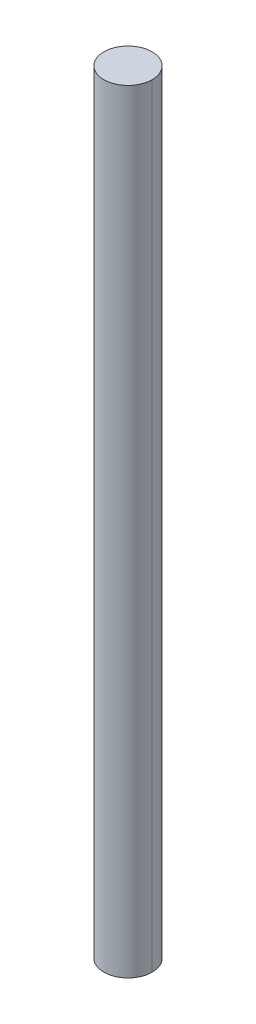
ISO-10303-21;
HEADER;
FILE_DESCRIPTION(('STEP AP214'),'2;1');
FILE_NAME('part.step','',(''),(''),'','','');
FILE_SCHEMA(('AUTOMOTIVE_DESIGN { 1 0 10303 214 1 1 1 1 }'));
ENDSEC;
DATA;
#1=APPLICATION_CONTEXT('core data for automotive mechanical design processes');
#2=APPLICATION_PROTOCOL_DEFINITION('international standard','automotive_design',2000,#1);
#3=PRODUCT_CONTEXT('',#1,'mechanical');
#4=PRODUCT('Part','Part','',(#3));
#5=PRODUCT_RELATED_PRODUCT_CATEGORY('part','',(#4));
#6=PRODUCT_DEFINITION_FORMATION('','',#4);
#7=PRODUCT_DEFINITION_CONTEXT('part definition',#1,'design');
#8=PRODUCT_DEFINITION('design','',#6,#7);
#9=PRODUCT_DEFINITION_SHAPE('','',#8);
#10=(LENGTH_UNIT() NAMED_UNIT(*) SI_UNIT(.MILLI.,.METRE.));
#11=(NAMED_UNIT(*) PLANE_ANGLE_UNIT() SI_UNIT($,.RADIAN.));
#12=(NAMED_UNIT(*) SI_UNIT($,.STERADIAN.) SOLID_ANGLE_UNIT());
#13=UNCERTAINTY_MEASURE_WITH_UNIT(LENGTH_MEASURE(1.E-05),#10,'distance_accuracy_value','');
#14=(GEOMETRIC_REPRESENTATION_CONTEXT(3) GLOBAL_UNCERTAINTY_ASSIGNED_CONTEXT((#13)) GLOBAL_UNIT_ASSIGNED_CONTEXT((#10,
#11,#12)) REPRESENTATION_CONTEXT('',''));
#15=CARTESIAN_POINT('',(0.,0.,0.));
#16=DIRECTION('',(0.,0.,1.));
#17=DIRECTION('',(1.,0.,0.));
#18=AXIS2_PLACEMENT_3D('',#15,#16,#17);
#19=CARTESIAN_POINT('',(0.,0.,0.));
#20=DIRECTION('',(0.,1.,0.));
#21=DIRECTION('',(1.,0.,0.));
#22=AXIS2_PLACEMENT_3D('',#19,#20,#21);
#23=CYLINDRICAL_SURFACE('',#22,3.175);
#24=CARTESIAN_POINT('',(-3.175,101.6,0.));
#25=CARTESIAN_POINT('',(-3.17500187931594,101.6,-0.0593727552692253));
#26=CARTESIAN_POINT('',(-3.17333465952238,101.6,-0.1187453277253));
#27=CARTESIAN_POINT('',(-3.16667552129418,101.6,-0.237303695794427));
#28=CARTESIAN_POINT('',(-3.16168360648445,101.6,-0.296489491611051));
#29=CARTESIAN_POINT('',(-3.14838858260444,101.6,-0.414487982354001));
#30=CARTESIAN_POINT('',(-3.14008547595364,101.6,-0.47330067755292));
#31=CARTESIAN_POINT('',(-3.1201947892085,101.6,-0.590367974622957));
#32=CARTESIAN_POINT('',(-3.10860721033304,101.6,-0.648622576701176));
#33=CARTESIAN_POINT('',(-3.08218387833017,101.6,-0.764390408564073));
#34=CARTESIAN_POINT('',(-3.06734812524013,101.6,-0.821903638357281));
#35=CARTESIAN_POINT('',(-3.03447516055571,101.6,-0.936007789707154));
#36=CARTESIAN_POINT('',(-3.01643794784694,101.6,-0.992598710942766));
#37=CARTESIAN_POINT('',(-2.97721879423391,101.6,-1.10468020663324));
#38=CARTESIAN_POINT('',(-2.9560368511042,101.6,-1.16017078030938));
#39=CARTESIAN_POINT('',(-2.91059487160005,101.6,-1.26987700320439));
#40=CARTESIAN_POINT('',(-2.88633483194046,101.6,-1.32409265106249));
#41=CARTESIAN_POINT('',(-2.83481303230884,101.6,-1.43107832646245));
#42=CARTESIAN_POINT('',(-2.80755127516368,101.6,-1.48384835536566));
#43=CARTESIAN_POINT('',(-2.75011188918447,101.6,-1.58777664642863));
#44=CARTESIAN_POINT('',(-2.71993426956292,101.6,-1.63893491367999));
#45=CARTESIAN_POINT('',(-2.65675810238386,101.6,-1.73947878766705));
#46=CARTESIAN_POINT('',(-2.62375956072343,101.6,-1.78886439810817));
#47=CARTESIAN_POINT('',(-2.55504535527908,101.6,-1.88570763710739));
#48=CARTESIAN_POINT('',(-2.51932969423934,101.6,-1.93316526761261));
#49=CARTESIAN_POINT('',(-2.44529359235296,101.6,-2.02600328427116));
#50=CARTESIAN_POINT('',(-2.40697315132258,101.6,-2.07138367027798));
#51=CARTESIAN_POINT('',(-2.32784801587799,101.6,-2.15992446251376));
#52=CARTESIAN_POINT('',(-2.2870433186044,101.6,-2.20308486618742));
#53=CARTESIAN_POINT('',(-2.20307800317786,101.6,-2.28704993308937));
#54=CARTESIAN_POINT('',(-2.15991737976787,101.6,-2.32785459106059));
#55=CARTESIAN_POINT('',(-2.0713759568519,101.6,-2.40697979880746));
#56=CARTESIAN_POINT('',(-2.02599515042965,101.6,-2.44530034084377));
#57=CARTESIAN_POINT('',(-1.93315638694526,101.6,-2.51933651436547));
#58=CARTESIAN_POINT('',(-1.88569843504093,101.6,-2.55505215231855));
#59=CARTESIAN_POINT('',(-1.78885480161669,101.6,-2.62376610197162));
#60=CARTESIAN_POINT('',(-1.73946912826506,101.6,-2.65676442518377));
#61=CARTESIAN_POINT('',(-1.63892537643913,101.6,-2.71994000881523));
#62=CARTESIAN_POINT('',(-1.5877673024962,101.6,-2.7501172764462));
#63=CARTESIAN_POINT('',(-1.483839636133,101.6,-2.80755587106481));
#64=CARTESIAN_POINT('',(-1.43107004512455,101.6,-2.83481720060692));
#65=CARTESIAN_POINT('',(-1.32408528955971,101.6,-2.88633819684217));
#66=CARTESIAN_POINT('',(-1.26987012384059,101.6,-2.91059786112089));
#67=CARTESIAN_POINT('',(-1.16016470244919,101.6,-2.95603922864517));
#68=CARTESIAN_POINT('',(-1.10467444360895,101.6,-2.9772209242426));
#69=CARTESIAN_POINT('',(-0.992593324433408,101.6,-3.01643971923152));
#70=CARTESIAN_POINT('',(-0.936002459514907,101.6,-3.03447680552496));
#71=CARTESIAN_POINT('',(-0.821898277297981,101.6,-3.06734956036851));
#72=CARTESIAN_POINT('',(-0.764384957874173,101.6,-3.08218522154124));
#73=CARTESIAN_POINT('',(-0.648617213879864,101.6,-3.1086083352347));
#74=CARTESIAN_POINT('',(-0.590362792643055,101.6,-3.12019580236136));
#75=CARTESIAN_POINT('',(-0.47329608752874,101.6,-3.14008612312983));
#76=CARTESIAN_POINT('',(-0.4144838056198,101.6,-3.14838898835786));
#77=CARTESIAN_POINT('',(-0.296486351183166,101.6,-3.16168402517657));
#78=CARTESIAN_POINT('',(-0.237301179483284,101.6,-3.16667620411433));
#79=CARTESIAN_POINT('',(-0.118744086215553,101.6,-3.17333418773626));
#80=CARTESIAN_POINT('',(-0.0593721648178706,101.6,-3.17499999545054));
#81=CARTESIAN_POINT('',(0.059371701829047,101.6,-3.17500000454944));
#82=CARTESIAN_POINT('',(0.118743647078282,101.6,-3.17333420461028));
#83=CARTESIAN_POINT('',(0.237300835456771,101.6,-3.16667623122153));
#84=CARTESIAN_POINT('',(0.296486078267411,101.6,-3.16168405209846));
#85=CARTESIAN_POINT('',(0.41448372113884,101.6,-3.14838900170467));
#86=CARTESIAN_POINT('',(0.47329612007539,101.6,-3.14008612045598));
#87=CARTESIAN_POINT('',(0.590363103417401,101.6,-3.12019574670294));
#88=CARTESIAN_POINT('',(0.648617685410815,101.6,-3.1086082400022));
#89=CARTESIAN_POINT('',(0.764385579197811,101.6,-3.08218506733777));
#90=CARTESIAN_POINT('',(0.821898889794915,101.6,-3.06734939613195));
#91=CARTESIAN_POINT('',(0.936002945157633,101.6,-3.03447665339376));
#92=CARTESIAN_POINT('',(0.992593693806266,101.6,-3.01643959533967));
#93=CARTESIAN_POINT('',(1.10467464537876,101.6,-2.97722084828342));
#94=CARTESIAN_POINT('',(1.16016485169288,101.6,-2.95603916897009));
#95=CARTESIAN_POINT('',(1.26987020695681,101.6,-2.91059782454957));
#96=CARTESIAN_POINT('',(1.32408535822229,101.6,-2.88633816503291));
#97=CARTESIAN_POINT('',(1.43107009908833,101.6,-2.8348171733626));
#98=CARTESIAN_POINT('',(1.48383968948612,101.6,-2.80755584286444));
#99=CARTESIAN_POINT('',(1.58776734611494,101.6,-2.7501172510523));
#100=CARTESIAN_POINT('',(1.63892541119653,101.6,-2.71993998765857));
#101=CARTESIAN_POINT('',(1.73946911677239,101.6,-2.65676443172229));
#102=CARTESIAN_POINT('',(1.78885475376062,101.6,-2.62376613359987));
#103=CARTESIAN_POINT('',(1.88569826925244,101.6,-2.5550522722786));
#104=CARTESIAN_POINT('',(1.93315614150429,101.6,-2.51933670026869));
#105=CARTESIAN_POINT('',(2.02599483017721,101.6,-2.44530060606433));
#106=CARTESIAN_POINT('',(2.07137563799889,101.6,-2.40698007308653));
#107=CARTESIAN_POINT('',(2.15991715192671,101.6,-2.3278548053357));
#108=CARTESIAN_POINT('',(2.20307786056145,101.6,-2.28705007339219));
#109=CARTESIAN_POINT('',(2.28704332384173,101.6,-2.20308486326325));
#110=CARTESIAN_POINT('',(2.32784808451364,101.6,-2.15992439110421));
#111=CARTESIAN_POINT('',(2.40697331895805,101.6,-2.07138347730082));
#112=CARTESIAN_POINT('',(2.44529379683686,101.6,-2.0260030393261));
#113=CARTESIAN_POINT('',(2.51932994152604,101.6,-1.93316494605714));
#114=CARTESIAN_POINT('',(2.55504561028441,101.6,-1.88570729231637));
#115=CARTESIAN_POINT('',(2.62375979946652,101.6,-1.78886404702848));
#116=CARTESIAN_POINT('',(2.65675831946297,101.6,-1.73947845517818));
#117=CARTESIAN_POINT('',(2.71993441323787,101.6,-1.63893467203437));
#118=CARTESIAN_POINT('',(2.7501119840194,101.6,-1.58777647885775));
#119=CARTESIAN_POINT('',(2.80755124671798,101.6,-1.48384840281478));
#120=CARTESIAN_POINT('',(2.83481293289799,101.6,-1.43107851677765));
#121=CARTESIAN_POINT('',(2.88633465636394,101.6,-1.32409303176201));
#122=CARTESIAN_POINT('',(2.91059468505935,101.6,-1.26987742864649));
#123=CARTESIAN_POINT('',(2.95603668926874,101.6,-1.16017119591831));
#124=CARTESIAN_POINT('',(2.97721866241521,101.6,-1.10468056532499));
#125=CARTESIAN_POINT('',(3.01643786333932,101.6,-0.992598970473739));
#126=CARTESIAN_POINT('',(3.03447509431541,101.6,-0.936008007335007));
#127=CARTESIAN_POINT('',(3.06734808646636,101.6,-0.821903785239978));
#128=CARTESIAN_POINT('',(3.08218384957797,101.6,-0.764390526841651));
#129=CARTESIAN_POINT('',(3.1086071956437,101.6,-0.648622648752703));
#130=CARTESIAN_POINT('',(3.12019477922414,101.6,-0.590368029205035));
#131=CARTESIAN_POINT('',(3.14008547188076,101.6,-0.473300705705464));
#132=CARTESIAN_POINT('',(3.1483885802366,101.6,-0.414488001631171));
#133=CARTESIAN_POINT('',(3.16168360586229,101.6,-0.296489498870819));
#134=CARTESIAN_POINT('',(3.16667552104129,101.6,-0.237303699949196));
#135=CARTESIAN_POINT('',(3.17333465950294,101.6,-0.118745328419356));
#136=CARTESIAN_POINT('',(3.17500187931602,101.6,-0.0593727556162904));
#137=CARTESIAN_POINT('',(3.175,101.6,0.));
#138=B_SPLINE_CURVE_WITH_KNOTS('',3,(#24,#25,#26,#27,#28,#29,#30,#31,#32,#33,#34,#35,#36,#37,
#38,#39,#40,#41,#42,#43,#44,#45,#46,#47,#48,#49,#50,#51,#52,#53,#54,#55,#56,#57,#58,#59,#60,#61,
#62,#63,#64,#65,#66,#67,#68,#69,#70,#71,#72,#73,#74,#75,#76,#77,#78,#79,#80,#81,#82,#83,#84,#85,
#86,#87,#88,#89,#90,#91,#92,#93,#94,#95,#96,#97,#98,#99,#100,#101,#102,#103,#104,#105,#106,#107,
#108,#109,#110,#111,#112,#113,#114,#115,#116,#117,#118,#119,#120,#121,#122,#123,#124,#125,#126,
#127,#128,#129,#130,#131,#132,#133,#134,#135,#136,#137),.UNSPECIFIED.,.F.,.F.,(4,2,2,2,2,2,2,2,
2,2,2,2,2,2,2,2,2,2,2,2,2,2,2,2,2,2,2,2,2,2,2,2,2,2,2,2,2,2,2,2,2,2,2,2,2,2,2,2,2,2,2,2,2,2,2,2,
4),(0.,0.178094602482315,0.356189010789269,0.534283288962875,0.712377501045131,
0.890471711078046,1.06856598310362,1.24666038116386,1.42475496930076,1.60284938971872,
1.78094324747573,1.95903673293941,2.13713003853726,2.31522335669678,2.49331687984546,
2.6714108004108,2.84950527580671,3.02759930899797,3.20569258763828,3.38378541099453,
3.56187807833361,3.73997088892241,3.91806414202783,4.09615813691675,4.27425254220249,
4.45234614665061,4.63043912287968,4.80853170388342,4.98662412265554,5.16471661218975,
5.34280940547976,5.52090273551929,5.69899683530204,5.87709122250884,6.05518485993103,
6.23327794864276,6.41137071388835,6.58946338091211,6.76755617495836,6.94564932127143,
7.12374304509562,7.30183750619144,7.4799317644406,7.65802556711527,7.83611907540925,
8.01421245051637,8.19230585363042,8.37039944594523,8.5484933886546,8.72658784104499,
8.9046824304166,9.08277683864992,9.26087113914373,9.43896540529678,9.61705971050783,
9.79515412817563,9.97324873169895),.UNSPECIFIED.);
#139=CARTESIAN_POINT('',(-3.175,101.6,0.));
#140=VERTEX_POINT('',#139);
#141=CARTESIAN_POINT('',(3.175,101.6,0.));
#142=VERTEX_POINT('',#141);
#143=EDGE_CURVE('E10',#140,#142,#138,.T.);
#144=ORIENTED_EDGE('',*,*,#143,.T.);
#145=CARTESIAN_POINT('',(3.175,0.,0.));
#146=CARTESIAN_POINT('',(3.175,0.846666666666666,0.));
#147=CARTESIAN_POINT('',(3.175,1.69333333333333,0.));
#148=CARTESIAN_POINT('',(3.175,3.38666666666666,0.));
#149=CARTESIAN_POINT('',(3.175,4.23333333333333,0.));
#150=CARTESIAN_POINT('',(3.175,5.92666666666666,0.));
#151=CARTESIAN_POINT('',(3.175,6.77333333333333,0.));
#152=CARTESIAN_POINT('',(3.175,8.46666666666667,0.));
#153=CARTESIAN_POINT('',(3.175,9.31333333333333,0.));
#154=CARTESIAN_POINT('',(3.175,11.0066666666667,0.));
#155=CARTESIAN_POINT('',(3.175,11.8533333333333,0.));
#156=CARTESIAN_POINT('',(3.175,13.5466666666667,0.));
#157=CARTESIAN_POINT('',(3.175,14.3933333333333,0.));
#158=CARTESIAN_POINT('',(3.175,16.0866666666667,0.));
#159=CARTESIAN_POINT('',(3.175,16.9333333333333,0.));
#160=CARTESIAN_POINT('',(3.175,18.6266666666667,0.));
#161=CARTESIAN_POINT('',(3.175,19.4733333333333,0.));
#162=CARTESIAN_POINT('',(3.175,21.1666666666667,0.));
#163=CARTESIAN_POINT('',(3.175,22.0133333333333,0.));
#164=CARTESIAN_POINT('',(3.175,23.7066666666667,0.));
#165=CARTESIAN_POINT('',(3.175,24.5533333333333,0.));
#166=CARTESIAN_POINT('',(3.175,26.2466666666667,0.));
#167=CARTESIAN_POINT('',(3.175,27.0933333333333,0.));
#168=CARTESIAN_POINT('',(3.175,28.7866666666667,0.));
#169=CARTESIAN_POINT('',(3.175,29.6333333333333,0.));
#170=CARTESIAN_POINT('',(3.175,31.3266666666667,0.));
#171=CARTESIAN_POINT('',(3.175,32.1733333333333,0.));
#172=CARTESIAN_POINT('',(3.175,33.8666666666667,0.));
#173=CARTESIAN_POINT('',(3.175,34.7133333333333,0.));
#174=CARTESIAN_POINT('',(3.175,36.4066666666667,0.));
#175=CARTESIAN_POINT('',(3.175,37.2533333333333,0.));
#176=CARTESIAN_POINT('',(3.175,38.9466666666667,0.));
#177=CARTESIAN_POINT('',(3.175,39.7933333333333,0.));
#178=CARTESIAN_POINT('',(3.175,41.4866666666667,0.));
#179=CARTESIAN_POINT('',(3.175,42.3333333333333,0.));
#180=CARTESIAN_POINT('',(3.175,44.0266666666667,0.));
#181=CARTESIAN_POINT('',(3.175,44.8733333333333,0.));
#182=CARTESIAN_POINT('',(3.175,46.5666666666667,0.));
#183=CARTESIAN_POINT('',(3.175,47.4133333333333,0.));
#184=CARTESIAN_POINT('',(3.175,49.1066666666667,0.));
#185=CARTESIAN_POINT('',(3.175,49.9533333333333,0.));
#186=CARTESIAN_POINT('',(3.175,51.6466666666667,0.));
#187=CARTESIAN_POINT('',(3.175,52.4933333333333,0.));
#188=CARTESIAN_POINT('',(3.175,54.1866666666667,0.));
#189=CARTESIAN_POINT('',(3.175,55.0333333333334,0.));
#190=CARTESIAN_POINT('',(3.175,56.7266666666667,0.));
#191=CARTESIAN_POINT('',(3.175,57.5733333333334,0.));
#192=CARTESIAN_POINT('',(3.175,59.2666666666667,0.));
#193=CARTESIAN_POINT('',(3.175,60.1133333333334,0.));
#194=CARTESIAN_POINT('',(3.175,61.8066666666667,0.));
#195=CARTESIAN_POINT('',(3.175,62.6533333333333,0.));
#196=CARTESIAN_POINT('',(3.175,64.3466666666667,0.));
#197=CARTESIAN_POINT('',(3.175,65.1933333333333,0.));
#198=CARTESIAN_POINT('',(3.175,66.8866666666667,0.));
#199=CARTESIAN_POINT('',(3.175,67.7333333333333,0.));
#200=CARTESIAN_POINT('',(3.175,69.4266666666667,0.));
#201=CARTESIAN_POINT('',(3.175,70.2733333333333,0.));
#202=CARTESIAN_POINT('',(3.175,71.9666666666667,0.));
#203=CARTESIAN_POINT('',(3.175,72.8133333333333,0.));
#204=CARTESIAN_POINT('',(3.175,74.5066666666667,0.));
#205=CARTESIAN_POINT('',(3.175,75.3533333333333,0.));
#206=CARTESIAN_POINT('',(3.175,77.0466666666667,0.));
#207=CARTESIAN_POINT('',(3.175,77.8933333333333,0.));
#208=CARTESIAN_POINT('',(3.175,79.5866666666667,0.));
#209=CARTESIAN_POINT('',(3.175,80.4333333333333,0.));
#210=CARTESIAN_POINT('',(3.175,82.1266666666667,0.));
#211=CARTESIAN_POINT('',(3.175,82.9733333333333,0.));
#212=CARTESIAN_POINT('',(3.175,84.6666666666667,0.));
#213=CARTESIAN_POINT('',(3.175,85.5133333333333,0.));
#214=CARTESIAN_POINT('',(3.175,87.2066666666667,0.));
#215=CARTESIAN_POINT('',(3.175,88.0533333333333,0.));
#216=CARTESIAN_POINT('',(3.175,89.7466666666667,0.));
#217=CARTESIAN_POINT('',(3.175,90.5933333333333,0.));
#218=CARTESIAN_POINT('',(3.175,92.2866666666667,0.));
#219=CARTESIAN_POINT('',(3.175,93.1333333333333,0.));
#220=CARTESIAN_POINT('',(3.175,94.8266666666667,0.));
#221=CARTESIAN_POINT('',(3.175,95.6733333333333,0.));
#222=CARTESIAN_POINT('',(3.175,97.3666666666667,0.));
#223=CARTESIAN_POINT('',(3.175,98.2133333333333,0.));
#224=CARTESIAN_POINT('',(3.175,99.9066666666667,0.));
#225=CARTESIAN_POINT('',(3.175,100.753333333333,0.));
#226=CARTESIAN_POINT('',(3.175,101.6,0.));
#227=B_SPLINE_CURVE_WITH_KNOTS('',3,(#145,#146,#147,#148,#149,#150,#151,#152,#153,#154,#155,
#156,#157,#158,#159,#160,#161,#162,#163,#164,#165,#166,#167,#168,#169,#170,#171,#172,#173,#174,
#175,#176,#177,#178,#179,#180,#181,#182,#183,#184,#185,#186,#187,#188,#189,#190,#191,#192,#193,
#194,#195,#196,#197,#198,#199,#200,#201,#202,#203,#204,#205,#206,#207,#208,#209,#210,#211,#212,
#213,#214,#215,#216,#217,#218,#219,#220,#221,#222,#223,#224,#225,#226),.UNSPECIFIED.,.F.,.F.,(4,
2,2,2,2,2,2,2,2,2,2,2,2,2,2,2,2,2,2,2,2,2,2,2,2,2,2,2,2,2,2,2,2,2,2,2,2,2,2,2,4),(0.,2.54,5.08,
7.62,10.16,12.7,15.24,17.78,20.32,22.86,25.4,27.94,30.48,33.02,35.56,38.1,40.64,43.18,45.72,
48.26,50.8,53.34,55.88,58.42,60.96,63.5,66.04,68.58,71.12,73.66,76.2,78.74,81.28,83.82,86.36,
88.9,91.44,93.98,96.52,99.06,101.6),.UNSPECIFIED.);
#228=CARTESIAN_POINT('',(3.175,0.,0.));
#229=VERTEX_POINT('',#228);
#230=EDGE_CURVE('E33',#229,#142,#227,.T.);
#231=ORIENTED_EDGE('',*,*,#230,.F.);
#232=CARTESIAN_POINT('',(3.175,0.,0.));
#233=CARTESIAN_POINT('',(3.17500187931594,0.,-0.0593727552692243));
#234=CARTESIAN_POINT('',(3.17333465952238,0.,-0.118745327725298));
#235=CARTESIAN_POINT('',(3.16667552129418,0.,-0.237303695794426));
#236=CARTESIAN_POINT('',(3.16168360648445,0.,-0.296489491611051));
#237=CARTESIAN_POINT('',(3.14838858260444,0.,-0.414487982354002));
#238=CARTESIAN_POINT('',(3.14008547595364,0.,-0.47330067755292));
#239=CARTESIAN_POINT('',(3.1201947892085,0.,-0.590367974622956));
#240=CARTESIAN_POINT('',(3.10860721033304,0.,-0.648622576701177));
#241=CARTESIAN_POINT('',(3.08218387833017,0.,-0.764390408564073));
#242=CARTESIAN_POINT('',(3.06734812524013,0.,-0.82190363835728));
#243=CARTESIAN_POINT('',(3.03447516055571,0.,-0.936007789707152));
#244=CARTESIAN_POINT('',(3.01643794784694,0.,-0.992598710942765));
#245=CARTESIAN_POINT('',(2.97721879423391,0.,-1.10468020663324));
#246=CARTESIAN_POINT('',(2.9560368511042,0.,-1.16017078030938));
#247=CARTESIAN_POINT('',(2.91059487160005,0.,-1.26987700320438));
#248=CARTESIAN_POINT('',(2.88633483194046,0.,-1.32409265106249));
#249=CARTESIAN_POINT('',(2.83481303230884,0.,-1.43107832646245));
#250=CARTESIAN_POINT('',(2.80755127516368,0.,-1.48384835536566));
#251=CARTESIAN_POINT('',(2.75011188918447,0.,-1.58777664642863));
#252=CARTESIAN_POINT('',(2.71993426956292,0.,-1.63893491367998));
#253=CARTESIAN_POINT('',(2.65675810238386,0.,-1.73947878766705));
#254=CARTESIAN_POINT('',(2.62375956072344,0.,-1.78886439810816));
#255=CARTESIAN_POINT('',(2.55504535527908,0.,-1.88570763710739));
#256=CARTESIAN_POINT('',(2.51932969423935,0.,-1.93316526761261));
#257=CARTESIAN_POINT('',(2.44529359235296,0.,-2.02600328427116));
#258=CARTESIAN_POINT('',(2.40697315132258,0.,-2.07138367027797));
#259=CARTESIAN_POINT('',(2.32784801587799,0.,-2.15992446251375));
#260=CARTESIAN_POINT('',(2.2870433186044,0.,-2.20308486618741));
#261=CARTESIAN_POINT('',(2.20307800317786,0.,-2.28704993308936));
#262=CARTESIAN_POINT('',(2.15991737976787,0.,-2.32785459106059));
#263=CARTESIAN_POINT('',(2.0713759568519,0.,-2.40697979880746));
#264=CARTESIAN_POINT('',(2.02599515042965,0.,-2.44530034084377));
#265=CARTESIAN_POINT('',(1.93315638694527,0.,-2.51933651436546));
#266=CARTESIAN_POINT('',(1.88569843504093,0.,-2.55505215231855));
#267=CARTESIAN_POINT('',(1.78885480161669,0.,-2.62376610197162));
#268=CARTESIAN_POINT('',(1.73946912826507,0.,-2.65676442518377));
#269=CARTESIAN_POINT('',(1.63892537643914,0.,-2.71994000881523));
#270=CARTESIAN_POINT('',(1.5877673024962,0.,-2.7501172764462));
#271=CARTESIAN_POINT('',(1.48383963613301,0.,-2.80755587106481));
#272=CARTESIAN_POINT('',(1.43107004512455,0.,-2.83481720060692));
#273=CARTESIAN_POINT('',(1.32408528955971,0.,-2.88633819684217));
#274=CARTESIAN_POINT('',(1.2698701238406,0.,-2.91059786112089));
#275=CARTESIAN_POINT('',(1.16016470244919,0.,-2.95603922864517));
#276=CARTESIAN_POINT('',(1.10467444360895,0.,-2.9772209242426));
#277=CARTESIAN_POINT('',(0.99259332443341,0.,-3.01643971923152));
#278=CARTESIAN_POINT('',(0.936002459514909,0.,-3.03447680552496));
#279=CARTESIAN_POINT('',(0.821898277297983,0.,-3.06734956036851));
#280=CARTESIAN_POINT('',(0.764384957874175,0.,-3.08218522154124));
#281=CARTESIAN_POINT('',(0.648617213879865,0.,-3.1086083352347));
#282=CARTESIAN_POINT('',(0.590362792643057,0.,-3.12019580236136));
#283=CARTESIAN_POINT('',(0.473296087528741,0.,-3.14008612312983));
#284=CARTESIAN_POINT('',(0.4144838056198,0.,-3.14838898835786));
#285=CARTESIAN_POINT('',(0.296486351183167,0.,-3.16168402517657));
#286=CARTESIAN_POINT('',(0.237301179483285,0.,-3.16667620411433));
#287=CARTESIAN_POINT('',(0.118744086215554,0.,-3.17333418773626));
#288=CARTESIAN_POINT('',(0.0593721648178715,0.,-3.17499999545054));
#289=CARTESIAN_POINT('',(-0.0593717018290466,0.,-3.17500000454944));
#290=CARTESIAN_POINT('',(-0.118743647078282,0.,-3.17333420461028));
#291=CARTESIAN_POINT('',(-0.23730083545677,0.,-3.16667623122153));
#292=CARTESIAN_POINT('',(-0.29648607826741,0.,-3.16168405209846));
#293=CARTESIAN_POINT('',(-0.414483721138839,0.,-3.14838900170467));
#294=CARTESIAN_POINT('',(-0.473296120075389,0.,-3.14008612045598));
#295=CARTESIAN_POINT('',(-0.5903631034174,0.,-3.12019574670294));
#296=CARTESIAN_POINT('',(-0.648617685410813,0.,-3.1086082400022));
#297=CARTESIAN_POINT('',(-0.764385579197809,0.,-3.08218506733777));
#298=CARTESIAN_POINT('',(-0.821898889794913,0.,-3.06734939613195));
#299=CARTESIAN_POINT('',(-0.936002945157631,0.,-3.03447665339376));
#300=CARTESIAN_POINT('',(-0.992593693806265,0.,-3.01643959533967));
#301=CARTESIAN_POINT('',(-1.10467464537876,0.,-2.97722084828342));
#302=CARTESIAN_POINT('',(-1.16016485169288,0.,-2.95603916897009));
#303=CARTESIAN_POINT('',(-1.26987020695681,0.,-2.91059782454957));
#304=CARTESIAN_POINT('',(-1.32408535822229,0.,-2.88633816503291));
#305=CARTESIAN_POINT('',(-1.43107009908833,0.,-2.8348171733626));
#306=CARTESIAN_POINT('',(-1.48383968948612,0.,-2.80755584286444));
#307=CARTESIAN_POINT('',(-1.58776734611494,0.,-2.7501172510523));
#308=CARTESIAN_POINT('',(-1.63892541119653,0.,-2.71993998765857));
#309=CARTESIAN_POINT('',(-1.73946911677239,0.,-2.65676443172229));
#310=CARTESIAN_POINT('',(-1.78885475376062,0.,-2.62376613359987));
#311=CARTESIAN_POINT('',(-1.88569826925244,0.,-2.5550522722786));
#312=CARTESIAN_POINT('',(-1.93315614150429,0.,-2.51933670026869));
#313=CARTESIAN_POINT('',(-2.02599483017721,0.,-2.44530060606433));
#314=CARTESIAN_POINT('',(-2.07137563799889,0.,-2.40698007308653));
#315=CARTESIAN_POINT('',(-2.15991715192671,0.,-2.3278548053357));
#316=CARTESIAN_POINT('',(-2.20307786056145,0.,-2.28705007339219));
#317=CARTESIAN_POINT('',(-2.28704332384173,0.,-2.20308486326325));
#318=CARTESIAN_POINT('',(-2.32784808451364,0.,-2.15992439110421));
#319=CARTESIAN_POINT('',(-2.40697331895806,0.,-2.07138347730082));
#320=CARTESIAN_POINT('',(-2.44529379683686,0.,-2.0260030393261));
#321=CARTESIAN_POINT('',(-2.51932994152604,0.,-1.93316494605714));
#322=CARTESIAN_POINT('',(-2.55504561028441,0.,-1.88570729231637));
#323=CARTESIAN_POINT('',(-2.62375979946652,0.,-1.78886404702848));
#324=CARTESIAN_POINT('',(-2.65675831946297,0.,-1.73947845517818));
#325=CARTESIAN_POINT('',(-2.71993441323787,0.,-1.63893467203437));
#326=CARTESIAN_POINT('',(-2.7501119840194,0.,-1.58777647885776));
#327=CARTESIAN_POINT('',(-2.80755124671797,0.,-1.48384840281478));
#328=CARTESIAN_POINT('',(-2.83481293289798,0.,-1.43107851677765));
#329=CARTESIAN_POINT('',(-2.88633465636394,0.,-1.32409303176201));
#330=CARTESIAN_POINT('',(-2.91059468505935,0.,-1.2698774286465));
#331=CARTESIAN_POINT('',(-2.95603668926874,0.,-1.16017119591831));
#332=CARTESIAN_POINT('',(-2.97721866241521,0.,-1.10468056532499));
#333=CARTESIAN_POINT('',(-3.01643786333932,0.,-0.992598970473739));
#334=CARTESIAN_POINT('',(-3.03447509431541,0.,-0.936008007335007));
#335=CARTESIAN_POINT('',(-3.06734808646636,0.,-0.821903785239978));
#336=CARTESIAN_POINT('',(-3.08218384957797,0.,-0.764390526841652));
#337=CARTESIAN_POINT('',(-3.1086071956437,0.,-0.648622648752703));
#338=CARTESIAN_POINT('',(-3.12019477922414,0.,-0.590368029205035));
#339=CARTESIAN_POINT('',(-3.14008547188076,0.,-0.473300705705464));
#340=CARTESIAN_POINT('',(-3.1483885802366,0.,-0.414488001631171));
#341=CARTESIAN_POINT('',(-3.16168360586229,0.,-0.29648949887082));
#342=CARTESIAN_POINT('',(-3.16667552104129,0.,-0.237303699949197));
#343=CARTESIAN_POINT('',(-3.17333465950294,0.,-0.118745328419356));
#344=CARTESIAN_POINT('',(-3.17500187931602,0.,-0.0593727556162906));
#345=CARTESIAN_POINT('',(-3.175,0.,0.));
#346=B_SPLINE_CURVE_WITH_KNOTS('',3,(#232,#233,#234,#235,#236,#237,#238,#239,#240,#241,#242,
#243,#244,#245,#246,#247,#248,#249,#250,#251,#252,#253,#254,#255,#256,#257,#258,#259,#260,#261,
#262,#263,#264,#265,#266,#267,#268,#269,#270,#271,#272,#273,#274,#275,#276,#277,#278,#279,#280,
#281,#282,#283,#284,#285,#286,#287,#288,#289,#290,#291,#292,#293,#294,#295,#296,#297,#298,#299,
#300,#301,#302,#303,#304,#305,#306,#307,#308,#309,#310,#311,#312,#313,#314,#315,#316,#317,#318,
#319,#320,#321,#322,#323,#324,#325,#326,#327,#328,#329,#330,#331,#332,#333,#334,#335,#336,#337,
#338,#339,#340,#341,#342,#343,#344,#345),.UNSPECIFIED.,.F.,.F.,(4,2,2,2,2,2,2,2,2,2,2,2,2,2,2,2,
2,2,2,2,2,2,2,2,2,2,2,2,2,2,2,2,2,2,2,2,2,2,2,2,2,2,2,2,2,2,2,2,2,2,2,2,2,2,2,2,4),(0.,
0.178094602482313,0.35618901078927,0.534283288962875,0.712377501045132,0.890471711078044,
1.06856598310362,1.24666038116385,1.42475496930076,1.60284938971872,1.78094324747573,
1.95903673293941,2.13713003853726,2.31522335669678,2.49331687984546,2.6714108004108,
2.84950527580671,3.02759930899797,3.20569258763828,3.38378541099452,3.5618780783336,
3.73997088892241,3.91806414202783,4.09615813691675,4.27425254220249,4.45234614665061,
4.63043912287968,4.80853170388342,4.98662412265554,5.16471661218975,5.34280940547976,
5.52090273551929,5.69899683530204,5.87709122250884,6.05518485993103,6.23327794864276,
6.41137071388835,6.58946338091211,6.76755617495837,6.94564932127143,7.12374304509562,
7.30183750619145,7.4799317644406,7.65802556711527,7.83611907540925,8.01421245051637,
8.19230585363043,8.37039944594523,8.5484933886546,8.72658784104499,8.9046824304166,
9.08277683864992,9.26087113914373,9.43896540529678,9.61705971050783,9.79515412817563,
9.97324873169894),.UNSPECIFIED.);
#347=CARTESIAN_POINT('',(-3.175,0.,0.));
#348=VERTEX_POINT('',#347);
#349=EDGE_CURVE('E23',#229,#348,#346,.T.);
#350=ORIENTED_EDGE('',*,*,#349,.T.);
#351=CARTESIAN_POINT('',(-3.175,0.,0.));
#352=CARTESIAN_POINT('',(-3.175,0.846666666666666,0.));
#353=CARTESIAN_POINT('',(-3.175,1.69333333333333,0.));
#354=CARTESIAN_POINT('',(-3.175,3.38666666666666,0.));
#355=CARTESIAN_POINT('',(-3.175,4.23333333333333,0.));
#356=CARTESIAN_POINT('',(-3.175,5.92666666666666,0.));
#357=CARTESIAN_POINT('',(-3.175,6.77333333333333,0.));
#358=CARTESIAN_POINT('',(-3.175,8.46666666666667,0.));
#359=CARTESIAN_POINT('',(-3.175,9.31333333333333,0.));
#360=CARTESIAN_POINT('',(-3.175,11.0066666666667,0.));
#361=CARTESIAN_POINT('',(-3.175,11.8533333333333,0.));
#362=CARTESIAN_POINT('',(-3.175,13.5466666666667,0.));
#363=CARTESIAN_POINT('',(-3.175,14.3933333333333,0.));
#364=CARTESIAN_POINT('',(-3.175,16.0866666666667,0.));
#365=CARTESIAN_POINT('',(-3.175,16.9333333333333,0.));
#366=CARTESIAN_POINT('',(-3.175,18.6266666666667,0.));
#367=CARTESIAN_POINT('',(-3.175,19.4733333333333,0.));
#368=CARTESIAN_POINT('',(-3.175,21.1666666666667,0.));
#369=CARTESIAN_POINT('',(-3.175,22.0133333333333,0.));
#370=CARTESIAN_POINT('',(-3.175,23.7066666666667,0.));
#371=CARTESIAN_POINT('',(-3.175,24.5533333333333,0.));
#372=CARTESIAN_POINT('',(-3.175,26.2466666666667,0.));
#373=CARTESIAN_POINT('',(-3.175,27.0933333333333,0.));
#374=CARTESIAN_POINT('',(-3.175,28.7866666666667,0.));
#375=CARTESIAN_POINT('',(-3.175,29.6333333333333,0.));
#376=CARTESIAN_POINT('',(-3.175,31.3266666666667,0.));
#377=CARTESIAN_POINT('',(-3.175,32.1733333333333,0.));
#378=CARTESIAN_POINT('',(-3.175,33.8666666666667,0.));
#379=CARTESIAN_POINT('',(-3.175,34.7133333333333,0.));
#380=CARTESIAN_POINT('',(-3.175,36.4066666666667,0.));
#381=CARTESIAN_POINT('',(-3.175,37.2533333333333,0.));
#382=CARTESIAN_POINT('',(-3.175,38.9466666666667,0.));
#383=CARTESIAN_POINT('',(-3.175,39.7933333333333,0.));
#384=CARTESIAN_POINT('',(-3.175,41.4866666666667,0.));
#385=CARTESIAN_POINT('',(-3.175,42.3333333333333,0.));
#386=CARTESIAN_POINT('',(-3.175,44.0266666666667,0.));
#387=CARTESIAN_POINT('',(-3.175,44.8733333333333,0.));
#388=CARTESIAN_POINT('',(-3.175,46.5666666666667,0.));
#389=CARTESIAN_POINT('',(-3.175,47.4133333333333,0.));
#390=CARTESIAN_POINT('',(-3.175,49.1066666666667,0.));
#391=CARTESIAN_POINT('',(-3.175,49.9533333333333,0.));
#392=CARTESIAN_POINT('',(-3.175,51.6466666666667,0.));
#393=CARTESIAN_POINT('',(-3.175,52.4933333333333,0.));
#394=CARTESIAN_POINT('',(-3.175,54.1866666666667,0.));
#395=CARTESIAN_POINT('',(-3.175,55.0333333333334,0.));
#396=CARTESIAN_POINT('',(-3.175,56.7266666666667,0.));
#397=CARTESIAN_POINT('',(-3.175,57.5733333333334,0.));
#398=CARTESIAN_POINT('',(-3.175,59.2666666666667,0.));
#399=CARTESIAN_POINT('',(-3.175,60.1133333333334,0.));
#400=CARTESIAN_POINT('',(-3.175,61.8066666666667,0.));
#401=CARTESIAN_POINT('',(-3.175,62.6533333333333,0.));
#402=CARTESIAN_POINT('',(-3.175,64.3466666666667,0.));
#403=CARTESIAN_POINT('',(-3.175,65.1933333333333,0.));
#404=CARTESIAN_POINT('',(-3.175,66.8866666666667,0.));
#405=CARTESIAN_POINT('',(-3.175,67.7333333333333,0.));
#406=CARTESIAN_POINT('',(-3.175,69.4266666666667,0.));
#407=CARTESIAN_POINT('',(-3.175,70.2733333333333,0.));
#408=CARTESIAN_POINT('',(-3.175,71.9666666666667,0.));
#409=CARTESIAN_POINT('',(-3.175,72.8133333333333,0.));
#410=CARTESIAN_POINT('',(-3.175,74.5066666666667,0.));
#411=CARTESIAN_POINT('',(-3.175,75.3533333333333,0.));
#412=CARTESIAN_POINT('',(-3.175,77.0466666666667,0.));
#413=CARTESIAN_POINT('',(-3.175,77.8933333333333,0.));
#414=CARTESIAN_POINT('',(-3.175,79.5866666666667,0.));
#415=CARTESIAN_POINT('',(-3.175,80.4333333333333,0.));
#416=CARTESIAN_POINT('',(-3.175,82.1266666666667,0.));
#417=CARTESIAN_POINT('',(-3.175,82.9733333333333,0.));
#418=CARTESIAN_POINT('',(-3.175,84.6666666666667,0.));
#419=CARTESIAN_POINT('',(-3.175,85.5133333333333,0.));
#420=CARTESIAN_POINT('',(-3.175,87.2066666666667,0.));
#421=CARTESIAN_POINT('',(-3.175,88.0533333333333,0.));
#422=CARTESIAN_POINT('',(-3.175,89.7466666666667,0.));
#423=CARTESIAN_POINT('',(-3.175,90.5933333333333,0.));
#424=CARTESIAN_POINT('',(-3.175,92.2866666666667,0.));
#425=CARTESIAN_POINT('',(-3.175,93.1333333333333,0.));
#426=CARTESIAN_POINT('',(-3.175,94.8266666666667,0.));
#427=CARTESIAN_POINT('',(-3.175,95.6733333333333,0.));
#428=CARTESIAN_POINT('',(-3.175,97.3666666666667,0.));
#429=CARTESIAN_POINT('',(-3.175,98.2133333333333,0.));
#430=CARTESIAN_POINT('',(-3.175,99.9066666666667,0.));
#431=CARTESIAN_POINT('',(-3.175,100.753333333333,0.));
#432=CARTESIAN_POINT('',(-3.175,101.6,0.));
#433=B_SPLINE_CURVE_WITH_KNOTS('',3,(#351,#352,#353,#354,#355,#356,#357,#358,#359,#360,#361,
#362,#363,#364,#365,#366,#367,#368,#369,#370,#371,#372,#373,#374,#375,#376,#377,#378,#379,#380,
#381,#382,#383,#384,#385,#386,#387,#388,#389,#390,#391,#392,#393,#394,#395,#396,#397,#398,#399,
#400,#401,#402,#403,#404,#405,#406,#407,#408,#409,#410,#411,#412,#413,#414,#415,#416,#417,#418,
#419,#420,#421,#422,#423,#424,#425,#426,#427,#428,#429,#430,#431,#432),.UNSPECIFIED.,.F.,.F.,(4,
2,2,2,2,2,2,2,2,2,2,2,2,2,2,2,2,2,2,2,2,2,2,2,2,2,2,2,2,2,2,2,2,2,2,2,2,2,2,2,4),(0.,2.54,5.08,
7.62,10.16,12.7,15.24,17.78,20.32,22.86,25.4,27.94,30.48,33.02,35.56,38.1,40.64,43.18,45.72,
48.26,50.8,53.34,55.88,58.42,60.96,63.5,66.04,68.58,71.12,73.66,76.2,78.74,81.28,83.82,86.36,
88.9,91.44,93.98,96.52,99.06,101.6),.UNSPECIFIED.);
#434=EDGE_CURVE('E40',#348,#140,#433,.T.);
#435=ORIENTED_EDGE('',*,*,#434,.T.);
#436=EDGE_LOOP('',(#144,#231,#350,#435));
#437=FACE_BOUND('',#436,.T.);
#438=ADVANCED_FACE('F15',(#437),#23,.T.);
#439=CARTESIAN_POINT('',(-3.175,101.6,-3.26462344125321));
#440=DIRECTION('',(0.,1.,0.));
#441=DIRECTION('',(0.,0.,1.));
#442=AXIS2_PLACEMENT_3D('',#439,#440,#441);
#443=PLANE('',#442);
#444=ORIENTED_EDGE('',*,*,#143,.F.);
#445=CARTESIAN_POINT('',(3.175,101.6,0.));
#446=CARTESIAN_POINT('',(3.17500187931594,101.6,0.0593727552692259));
#447=CARTESIAN_POINT('',(3.17333465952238,101.6,0.1187453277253));
#448=CARTESIAN_POINT('',(3.16667552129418,101.6,0.237303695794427));
#449=CARTESIAN_POINT('',(3.16168360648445,101.6,0.296489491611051));
#450=CARTESIAN_POINT('',(3.14838858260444,101.6,0.414487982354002));
#451=CARTESIAN_POINT('',(3.14008547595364,101.6,0.47330067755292));
#452=CARTESIAN_POINT('',(3.1201947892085,101.6,0.590367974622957));
#453=CARTESIAN_POINT('',(3.10860721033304,101.6,0.648622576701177));
#454=CARTESIAN_POINT('',(3.08218387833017,101.6,0.764390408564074));
#455=CARTESIAN_POINT('',(3.06734812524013,101.6,0.821903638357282));
#456=CARTESIAN_POINT('',(3.03447516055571,101.6,0.936007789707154));
#457=CARTESIAN_POINT('',(3.01643794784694,101.6,0.992598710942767));
#458=CARTESIAN_POINT('',(2.97721879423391,101.6,1.10468020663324));
#459=CARTESIAN_POINT('',(2.9560368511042,101.6,1.16017078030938));
#460=CARTESIAN_POINT('',(2.91059487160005,101.6,1.26987700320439));
#461=CARTESIAN_POINT('',(2.88633483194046,101.6,1.32409265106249));
#462=CARTESIAN_POINT('',(2.83481303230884,101.6,1.43107832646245));
#463=CARTESIAN_POINT('',(2.80755127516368,101.6,1.48384835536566));
#464=CARTESIAN_POINT('',(2.75011188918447,101.6,1.58777664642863));
#465=CARTESIAN_POINT('',(2.71993426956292,101.6,1.63893491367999));
#466=CARTESIAN_POINT('',(2.65675810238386,101.6,1.73947878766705));
#467=CARTESIAN_POINT('',(2.62375956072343,101.6,1.78886439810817));
#468=CARTESIAN_POINT('',(2.55504535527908,101.6,1.88570763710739));
#469=CARTESIAN_POINT('',(2.51932969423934,101.6,1.93316526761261));
#470=CARTESIAN_POINT('',(2.44529359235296,101.6,2.02600328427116));
#471=CARTESIAN_POINT('',(2.40697315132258,101.6,2.07138367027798));
#472=CARTESIAN_POINT('',(2.32784801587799,101.6,2.15992446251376));
#473=CARTESIAN_POINT('',(2.2870433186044,101.6,2.20308486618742));
#474=CARTESIAN_POINT('',(2.20307800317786,101.6,2.28704993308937));
#475=CARTESIAN_POINT('',(2.15991737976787,101.6,2.32785459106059));
#476=CARTESIAN_POINT('',(2.0713759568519,101.6,2.40697979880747));
#477=CARTESIAN_POINT('',(2.02599515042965,101.6,2.44530034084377));
#478=CARTESIAN_POINT('',(1.93315638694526,101.6,2.51933651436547));
#479=CARTESIAN_POINT('',(1.88569843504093,101.6,2.55505215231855));
#480=CARTESIAN_POINT('',(1.78885480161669,101.6,2.62376610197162));
#481=CARTESIAN_POINT('',(1.73946912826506,101.6,2.65676442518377));
#482=CARTESIAN_POINT('',(1.63892537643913,101.6,2.71994000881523));
#483=CARTESIAN_POINT('',(1.5877673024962,101.6,2.7501172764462));
#484=CARTESIAN_POINT('',(1.483839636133,101.6,2.80755587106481));
#485=CARTESIAN_POINT('',(1.43107004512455,101.6,2.83481720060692));
#486=CARTESIAN_POINT('',(1.3240852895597,101.6,2.88633819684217));
#487=CARTESIAN_POINT('',(1.26987012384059,101.6,2.91059786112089));
#488=CARTESIAN_POINT('',(1.16016470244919,101.6,2.95603922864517));
#489=CARTESIAN_POINT('',(1.10467444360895,101.6,2.9772209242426));
#490=CARTESIAN_POINT('',(0.992593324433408,101.6,3.01643971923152));
#491=CARTESIAN_POINT('',(0.936002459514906,101.6,3.03447680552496));
#492=CARTESIAN_POINT('',(0.82189827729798,101.6,3.06734956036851));
#493=CARTESIAN_POINT('',(0.764384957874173,101.6,3.08218522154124));
#494=CARTESIAN_POINT('',(0.648617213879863,101.6,3.1086083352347));
#495=CARTESIAN_POINT('',(0.590362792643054,101.6,3.12019580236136));
#496=CARTESIAN_POINT('',(0.473296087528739,101.6,3.14008612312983));
#497=CARTESIAN_POINT('',(0.414483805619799,101.6,3.14838898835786));
#498=CARTESIAN_POINT('',(0.296486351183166,101.6,3.16168402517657));
#499=CARTESIAN_POINT('',(0.237301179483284,101.6,3.16667620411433));
#500=CARTESIAN_POINT('',(0.118744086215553,101.6,3.17333418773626));
#501=CARTESIAN_POINT('',(0.0593721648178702,101.6,3.17499999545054));
#502=CARTESIAN_POINT('',(-0.0593717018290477,101.6,3.17500000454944));
#503=CARTESIAN_POINT('',(-0.118743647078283,101.6,3.17333420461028));
#504=CARTESIAN_POINT('',(-0.237300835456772,101.6,3.16667623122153));
#505=CARTESIAN_POINT('',(-0.296486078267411,101.6,3.16168405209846));
#506=CARTESIAN_POINT('',(-0.414483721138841,101.6,3.14838900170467));
#507=CARTESIAN_POINT('',(-0.473296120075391,101.6,3.14008612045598));
#508=CARTESIAN_POINT('',(-0.590363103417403,101.6,3.12019574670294));
#509=CARTESIAN_POINT('',(-0.648617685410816,101.6,3.1086082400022));
#510=CARTESIAN_POINT('',(-0.764385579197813,101.6,3.08218506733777));
#511=CARTESIAN_POINT('',(-0.821898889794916,101.6,3.06734939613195));
#512=CARTESIAN_POINT('',(-0.936002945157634,101.6,3.03447665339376));
#513=CARTESIAN_POINT('',(-0.992593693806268,101.6,3.01643959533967));
#514=CARTESIAN_POINT('',(-1.10467464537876,101.6,2.97722084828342));
#515=CARTESIAN_POINT('',(-1.16016485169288,101.6,2.95603916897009));
#516=CARTESIAN_POINT('',(-1.26987020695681,101.6,2.91059782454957));
#517=CARTESIAN_POINT('',(-1.32408535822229,101.6,2.88633816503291));
#518=CARTESIAN_POINT('',(-1.43107009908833,101.6,2.8348171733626));
#519=CARTESIAN_POINT('',(-1.48383968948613,101.6,2.80755584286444));
#520=CARTESIAN_POINT('',(-1.58776734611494,101.6,2.75011725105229));
#521=CARTESIAN_POINT('',(-1.63892541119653,101.6,2.71993998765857));
#522=CARTESIAN_POINT('',(-1.73946911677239,101.6,2.65676443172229));
#523=CARTESIAN_POINT('',(-1.78885475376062,101.6,2.62376613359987));
#524=CARTESIAN_POINT('',(-1.88569826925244,101.6,2.5550522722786));
#525=CARTESIAN_POINT('',(-1.93315614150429,101.6,2.51933670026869));
#526=CARTESIAN_POINT('',(-2.02599483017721,101.6,2.44530060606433));
#527=CARTESIAN_POINT('',(-2.07137563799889,101.6,2.40698007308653));
#528=CARTESIAN_POINT('',(-2.15991715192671,101.6,2.3278548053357));
#529=CARTESIAN_POINT('',(-2.20307786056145,101.6,2.28705007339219));
#530=CARTESIAN_POINT('',(-2.28704332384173,101.6,2.20308486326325));
#531=CARTESIAN_POINT('',(-2.32784808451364,101.6,2.15992439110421));
#532=CARTESIAN_POINT('',(-2.40697331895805,101.6,2.07138347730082));
#533=CARTESIAN_POINT('',(-2.44529379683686,101.6,2.0260030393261));
#534=CARTESIAN_POINT('',(-2.51932994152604,101.6,1.93316494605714));
#535=CARTESIAN_POINT('',(-2.55504561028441,101.6,1.88570729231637));
#536=CARTESIAN_POINT('',(-2.62375979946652,101.6,1.78886404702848));
#537=CARTESIAN_POINT('',(-2.65675831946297,101.6,1.73947845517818));
#538=CARTESIAN_POINT('',(-2.71993441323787,101.6,1.63893467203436));
#539=CARTESIAN_POINT('',(-2.7501119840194,101.6,1.58777647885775));
#540=CARTESIAN_POINT('',(-2.80755124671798,101.6,1.48384840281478));
#541=CARTESIAN_POINT('',(-2.83481293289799,101.6,1.43107851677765));
#542=CARTESIAN_POINT('',(-2.88633465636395,101.6,1.32409303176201));
#543=CARTESIAN_POINT('',(-2.91059468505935,101.6,1.26987742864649));
#544=CARTESIAN_POINT('',(-2.95603668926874,101.6,1.16017119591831));
#545=CARTESIAN_POINT('',(-2.97721866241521,101.6,1.10468056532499));
#546=CARTESIAN_POINT('',(-3.01643786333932,101.6,0.992598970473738));
#547=CARTESIAN_POINT('',(-3.03447509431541,101.6,0.936008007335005));
#548=CARTESIAN_POINT('',(-3.06734808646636,101.6,0.821903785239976));
#549=CARTESIAN_POINT('',(-3.08218384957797,101.6,0.76439052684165));
#550=CARTESIAN_POINT('',(-3.1086071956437,101.6,0.648622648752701));
#551=CARTESIAN_POINT('',(-3.12019477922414,101.6,0.590368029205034));
#552=CARTESIAN_POINT('',(-3.14008547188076,101.6,0.473300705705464));
#553=CARTESIAN_POINT('',(-3.1483885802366,101.6,0.41448800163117));
#554=CARTESIAN_POINT('',(-3.16168360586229,101.6,0.296489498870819));
#555=CARTESIAN_POINT('',(-3.16667552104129,101.6,0.237303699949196));
#556=CARTESIAN_POINT('',(-3.17333465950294,101.6,0.118745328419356));
#557=CARTESIAN_POINT('',(-3.17500187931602,101.6,0.0593727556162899));
#558=CARTESIAN_POINT('',(-3.175,101.6,0.));
#559=B_SPLINE_CURVE_WITH_KNOTS('',3,(#445,#446,#447,#448,#449,#450,#451,#452,#453,#454,#455,
#456,#457,#458,#459,#460,#461,#462,#463,#464,#465,#466,#467,#468,#469,#470,#471,#472,#473,#474,
#475,#476,#477,#478,#479,#480,#481,#482,#483,#484,#485,#486,#487,#488,#489,#490,#491,#492,#493,
#494,#495,#496,#497,#498,#499,#500,#501,#502,#503,#504,#505,#506,#507,#508,#509,#510,#511,#512,
#513,#514,#515,#516,#517,#518,#519,#520,#521,#522,#523,#524,#525,#526,#527,#528,#529,#530,#531,
#532,#533,#534,#535,#536,#537,#538,#539,#540,#541,#542,#543,#544,#545,#546,#547,#548,#549,#550,
#551,#552,#553,#554,#555,#556,#557,#558),.UNSPECIFIED.,.F.,.F.,(4,2,2,2,2,2,2,2,2,2,2,2,2,2,2,2,
2,2,2,2,2,2,2,2,2,2,2,2,2,2,2,2,2,2,2,2,2,2,2,2,2,2,2,2,2,2,2,2,2,2,2,2,2,2,2,2,4),(0.,
0.178094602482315,0.356189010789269,0.534283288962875,0.712377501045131,0.890471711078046,
1.06856598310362,1.24666038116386,1.42475496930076,1.60284938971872,1.78094324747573,
1.95903673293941,2.13713003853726,2.31522335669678,2.49331687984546,2.6714108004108,
2.84950527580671,3.02759930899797,3.20569258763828,3.38378541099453,3.56187807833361,
3.73997088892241,3.91806414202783,4.09615813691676,4.2742525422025,4.45234614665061,
4.63043912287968,4.80853170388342,4.98662412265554,5.16471661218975,5.34280940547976,
5.52090273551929,5.69899683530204,5.87709122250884,6.05518485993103,6.23327794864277,
6.41137071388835,6.58946338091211,6.76755617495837,6.94564932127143,7.12374304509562,
7.30183750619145,7.4799317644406,7.65802556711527,7.83611907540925,8.01421245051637,
8.19230585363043,8.37039944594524,8.5484933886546,8.72658784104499,8.9046824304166,
9.08277683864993,9.26087113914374,9.43896540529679,9.61705971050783,9.79515412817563,
9.97324873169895),.UNSPECIFIED.);
#560=EDGE_CURVE('E54',#142,#140,#559,.T.);
#561=ORIENTED_EDGE('',*,*,#560,.F.);
#562=EDGE_LOOP('',(#444,#561));
#563=FACE_BOUND('',#562,.T.);
#564=ADVANCED_FACE('F53',(#563),#443,.T.);
#565=CARTESIAN_POINT('',(0.,0.,0.));
#566=DIRECTION('',(0.,1.,0.));
#567=DIRECTION('',(-1.,0.,0.));
#568=AXIS2_PLACEMENT_3D('',#565,#566,#567);
#569=CYLINDRICAL_SURFACE('',#568,3.175);
#570=CARTESIAN_POINT('',(-3.175,0.,0.));
#571=CARTESIAN_POINT('',(-3.17500187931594,0.,0.0593727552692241));
#572=CARTESIAN_POINT('',(-3.17333465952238,0.,0.118745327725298));
#573=CARTESIAN_POINT('',(-3.16667552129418,0.,0.237303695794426));
#574=CARTESIAN_POINT('',(-3.16168360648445,0.,0.296489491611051));
#575=CARTESIAN_POINT('',(-3.14838858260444,0.,0.414487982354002));
#576=CARTESIAN_POINT('',(-3.14008547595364,0.,0.47330067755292));
#577=CARTESIAN_POINT('',(-3.1201947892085,0.,0.590367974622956));
#578=CARTESIAN_POINT('',(-3.10860721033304,0.,0.648622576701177));
#579=CARTESIAN_POINT('',(-3.08218387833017,0.,0.764390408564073));
#580=CARTESIAN_POINT('',(-3.06734812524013,0.,0.821903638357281));
#581=CARTESIAN_POINT('',(-3.03447516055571,0.,0.936007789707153));
#582=CARTESIAN_POINT('',(-3.01643794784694,0.,0.992598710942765));
#583=CARTESIAN_POINT('',(-2.97721879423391,0.,1.10468020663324));
#584=CARTESIAN_POINT('',(-2.9560368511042,0.,1.16017078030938));
#585=CARTESIAN_POINT('',(-2.91059487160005,0.,1.26987700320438));
#586=CARTESIAN_POINT('',(-2.88633483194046,0.,1.32409265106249));
#587=CARTESIAN_POINT('',(-2.83481303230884,0.,1.43107832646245));
#588=CARTESIAN_POINT('',(-2.80755127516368,0.,1.48384835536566));
#589=CARTESIAN_POINT('',(-2.75011188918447,0.,1.58777664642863));
#590=CARTESIAN_POINT('',(-2.71993426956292,0.,1.63893491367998));
#591=CARTESIAN_POINT('',(-2.65675810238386,0.,1.73947878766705));
#592=CARTESIAN_POINT('',(-2.62375956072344,0.,1.78886439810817));
#593=CARTESIAN_POINT('',(-2.55504535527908,0.,1.88570763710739));
#594=CARTESIAN_POINT('',(-2.51932969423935,0.,1.93316526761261));
#595=CARTESIAN_POINT('',(-2.44529359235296,0.,2.02600328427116));
#596=CARTESIAN_POINT('',(-2.40697315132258,0.,2.07138367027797));
#597=CARTESIAN_POINT('',(-2.32784801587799,0.,2.15992446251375));
#598=CARTESIAN_POINT('',(-2.2870433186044,0.,2.20308486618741));
#599=CARTESIAN_POINT('',(-2.20307800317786,0.,2.28704993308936));
#600=CARTESIAN_POINT('',(-2.15991737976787,0.,2.32785459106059));
#601=CARTESIAN_POINT('',(-2.0713759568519,0.,2.40697979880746));
#602=CARTESIAN_POINT('',(-2.02599515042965,0.,2.44530034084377));
#603=CARTESIAN_POINT('',(-1.93315638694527,0.,2.51933651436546));
#604=CARTESIAN_POINT('',(-1.88569843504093,0.,2.55505215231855));
#605=CARTESIAN_POINT('',(-1.78885480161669,0.,2.62376610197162));
#606=CARTESIAN_POINT('',(-1.73946912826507,0.,2.65676442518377));
#607=CARTESIAN_POINT('',(-1.63892537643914,0.,2.71994000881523));
#608=CARTESIAN_POINT('',(-1.5877673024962,0.,2.7501172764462));
#609=CARTESIAN_POINT('',(-1.48383963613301,0.,2.80755587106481));
#610=CARTESIAN_POINT('',(-1.43107004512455,0.,2.83481720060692));
#611=CARTESIAN_POINT('',(-1.32408528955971,0.,2.88633819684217));
#612=CARTESIAN_POINT('',(-1.2698701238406,0.,2.91059786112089));
#613=CARTESIAN_POINT('',(-1.16016470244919,0.,2.95603922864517));
#614=CARTESIAN_POINT('',(-1.10467444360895,0.,2.9772209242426));
#615=CARTESIAN_POINT('',(-0.992593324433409,0.,3.01643971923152));
#616=CARTESIAN_POINT('',(-0.936002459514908,0.,3.03447680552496));
#617=CARTESIAN_POINT('',(-0.821898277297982,0.,3.06734956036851));
#618=CARTESIAN_POINT('',(-0.764384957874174,0.,3.08218522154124));
#619=CARTESIAN_POINT('',(-0.648617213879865,0.,3.1086083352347));
#620=CARTESIAN_POINT('',(-0.590362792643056,0.,3.12019580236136));
#621=CARTESIAN_POINT('',(-0.47329608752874,0.,3.14008612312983));
#622=CARTESIAN_POINT('',(-0.4144838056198,0.,3.14838898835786));
#623=CARTESIAN_POINT('',(-0.296486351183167,0.,3.16168402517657));
#624=CARTESIAN_POINT('',(-0.237301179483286,0.,3.16667620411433));
#625=CARTESIAN_POINT('',(-0.118744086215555,0.,3.17333418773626));
#626=CARTESIAN_POINT('',(-0.0593721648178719,0.,3.17499999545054));
#627=CARTESIAN_POINT('',(0.0593717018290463,0.,3.17500000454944));
#628=CARTESIAN_POINT('',(0.118743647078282,0.,3.17333420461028));
#629=CARTESIAN_POINT('',(0.23730083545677,0.,3.16667623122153));
#630=CARTESIAN_POINT('',(0.29648607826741,0.,3.16168405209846));
#631=CARTESIAN_POINT('',(0.414483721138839,0.,3.14838900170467));
#632=CARTESIAN_POINT('',(0.473296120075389,0.,3.14008612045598));
#633=CARTESIAN_POINT('',(0.590363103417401,0.,3.12019574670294));
#634=CARTESIAN_POINT('',(0.648617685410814,0.,3.1086082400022));
#635=CARTESIAN_POINT('',(0.764385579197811,0.,3.08218506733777));
#636=CARTESIAN_POINT('',(0.821898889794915,0.,3.06734939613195));
#637=CARTESIAN_POINT('',(0.936002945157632,0.,3.03447665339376));
#638=CARTESIAN_POINT('',(0.992593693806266,0.,3.01643959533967));
#639=CARTESIAN_POINT('',(1.10467464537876,0.,2.97722084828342));
#640=CARTESIAN_POINT('',(1.16016485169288,0.,2.95603916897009));
#641=CARTESIAN_POINT('',(1.26987020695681,0.,2.91059782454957));
#642=CARTESIAN_POINT('',(1.32408535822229,0.,2.88633816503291));
#643=CARTESIAN_POINT('',(1.43107009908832,0.,2.8348171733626));
#644=CARTESIAN_POINT('',(1.48383968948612,0.,2.80755584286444));
#645=CARTESIAN_POINT('',(1.58776734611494,0.,2.7501172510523));
#646=CARTESIAN_POINT('',(1.63892541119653,0.,2.71993998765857));
#647=CARTESIAN_POINT('',(1.73946911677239,0.,2.65676443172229));
#648=CARTESIAN_POINT('',(1.78885475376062,0.,2.62376613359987));
#649=CARTESIAN_POINT('',(1.88569826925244,0.,2.5550522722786));
#650=CARTESIAN_POINT('',(1.93315614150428,0.,2.51933670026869));
#651=CARTESIAN_POINT('',(2.02599483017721,0.,2.44530060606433));
#652=CARTESIAN_POINT('',(2.07137563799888,0.,2.40698007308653));
#653=CARTESIAN_POINT('',(2.15991715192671,0.,2.3278548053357));
#654=CARTESIAN_POINT('',(2.20307786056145,0.,2.28705007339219));
#655=CARTESIAN_POINT('',(2.28704332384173,0.,2.20308486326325));
#656=CARTESIAN_POINT('',(2.32784808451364,0.,2.15992439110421));
#657=CARTESIAN_POINT('',(2.40697331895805,0.,2.07138347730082));
#658=CARTESIAN_POINT('',(2.44529379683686,0.,2.0260030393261));
#659=CARTESIAN_POINT('',(2.51932994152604,0.,1.93316494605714));
#660=CARTESIAN_POINT('',(2.5550456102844,0.,1.88570729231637));
#661=CARTESIAN_POINT('',(2.62375979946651,0.,1.78886404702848));
#662=CARTESIAN_POINT('',(2.65675831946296,0.,1.73947845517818));
#663=CARTESIAN_POINT('',(2.71993441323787,0.,1.63893467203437));
#664=CARTESIAN_POINT('',(2.7501119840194,0.,1.58777647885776));
#665=CARTESIAN_POINT('',(2.80755124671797,0.,1.48384840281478));
#666=CARTESIAN_POINT('',(2.83481293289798,0.,1.43107851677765));
#667=CARTESIAN_POINT('',(2.88633465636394,0.,1.32409303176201));
#668=CARTESIAN_POINT('',(2.91059468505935,0.,1.2698774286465));
#669=CARTESIAN_POINT('',(2.95603668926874,0.,1.16017119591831));
#670=CARTESIAN_POINT('',(2.97721866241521,0.,1.10468056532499));
#671=CARTESIAN_POINT('',(3.01643786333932,0.,0.992598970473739));
#672=CARTESIAN_POINT('',(3.03447509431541,0.,0.936008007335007));
#673=CARTESIAN_POINT('',(3.06734808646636,0.,0.821903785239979));
#674=CARTESIAN_POINT('',(3.08218384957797,0.,0.764390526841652));
#675=CARTESIAN_POINT('',(3.1086071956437,0.,0.648622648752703));
#676=CARTESIAN_POINT('',(3.12019477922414,0.,0.590368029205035));
#677=CARTESIAN_POINT('',(3.14008547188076,0.,0.473300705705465));
#678=CARTESIAN_POINT('',(3.1483885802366,0.,0.414488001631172));
#679=CARTESIAN_POINT('',(3.16168360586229,0.,0.296489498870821));
#680=CARTESIAN_POINT('',(3.16667552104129,0.,0.237303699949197));
#681=CARTESIAN_POINT('',(3.17333465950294,0.,0.118745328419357));
#682=CARTESIAN_POINT('',(3.17500187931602,0.,0.059372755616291));
#683=CARTESIAN_POINT('',(3.175,0.,0.));
#684=B_SPLINE_CURVE_WITH_KNOTS('',3,(#570,#571,#572,#573,#574,#575,#576,#577,#578,#579,#580,
#581,#582,#583,#584,#585,#586,#587,#588,#589,#590,#591,#592,#593,#594,#595,#596,#597,#598,#599,
#600,#601,#602,#603,#604,#605,#606,#607,#608,#609,#610,#611,#612,#613,#614,#615,#616,#617,#618,
#619,#620,#621,#622,#623,#624,#625,#626,#627,#628,#629,#630,#631,#632,#633,#634,#635,#636,#637,
#638,#639,#640,#641,#642,#643,#644,#645,#646,#647,#648,#649,#650,#651,#652,#653,#654,#655,#656,
#657,#658,#659,#660,#661,#662,#663,#664,#665,#666,#667,#668,#669,#670,#671,#672,#673,#674,#675,
#676,#677,#678,#679,#680,#681,#682,#683),.UNSPECIFIED.,.F.,.F.,(4,2,2,2,2,2,2,2,2,2,2,2,2,2,2,2,
2,2,2,2,2,2,2,2,2,2,2,2,2,2,2,2,2,2,2,2,2,2,2,2,2,2,2,2,2,2,2,2,2,2,2,2,2,2,2,2,4),(0.,
0.178094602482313,0.356189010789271,0.534283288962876,0.712377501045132,0.890471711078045,
1.06856598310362,1.24666038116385,1.42475496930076,1.60284938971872,1.78094324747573,
1.95903673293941,2.13713003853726,2.31522335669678,2.49331687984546,2.6714108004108,
2.84950527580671,3.02759930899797,3.20569258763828,3.38378541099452,3.5618780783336,
3.73997088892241,3.91806414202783,4.09615813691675,4.27425254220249,4.45234614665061,
4.63043912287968,4.80853170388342,4.98662412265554,5.16471661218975,5.34280940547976,
5.52090273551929,5.69899683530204,5.87709122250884,6.05518485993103,6.23327794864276,
6.41137071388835,6.58946338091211,6.76755617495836,6.94564932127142,7.12374304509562,
7.30183750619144,7.4799317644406,7.65802556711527,7.83611907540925,8.01421245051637,
8.19230585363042,8.37039944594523,8.5484933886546,8.72658784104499,8.9046824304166,
9.08277683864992,9.26087113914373,9.43896540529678,9.61705971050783,9.79515412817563,
9.97324873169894),.UNSPECIFIED.);
#685=EDGE_CURVE('E48',#348,#229,#684,.T.);
#686=ORIENTED_EDGE('',*,*,#685,.T.);
#687=ORIENTED_EDGE('',*,*,#230,.T.);
#688=ORIENTED_EDGE('',*,*,#560,.T.);
#689=ORIENTED_EDGE('',*,*,#434,.F.);
#690=EDGE_LOOP('',(#686,#687,#688,#689));
#691=FACE_BOUND('',#690,.T.);
#692=ADVANCED_FACE('F58',(#691),#569,.T.);
#693=CARTESIAN_POINT('',(-3.175,0.,-3.26462344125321));
#694=DIRECTION('',(0.,-1.,0.));
#695=DIRECTION('',(1.,0.,0.));
#696=AXIS2_PLACEMENT_3D('',#693,#694,#695);
#697=PLANE('',#696);
#698=ORIENTED_EDGE('',*,*,#349,.F.);
#699=ORIENTED_EDGE('',*,*,#685,.F.);
#700=EDGE_LOOP('',(#698,#699));
#701=FACE_BOUND('',#700,.T.);
#702=ADVANCED_FACE('F76',(#701),#697,.T.);
#703=CLOSED_SHELL('',(#438,#564,#692,#702));
#704=MANIFOLD_SOLID_BREP('B1',#703);
#705=ADVANCED_BREP_SHAPE_REPRESENTATION('',(#18,#704),#14);
#706=SHAPE_DEFINITION_REPRESENTATION(#9,#705);
ENDSEC;
END-ISO-10303-21;
